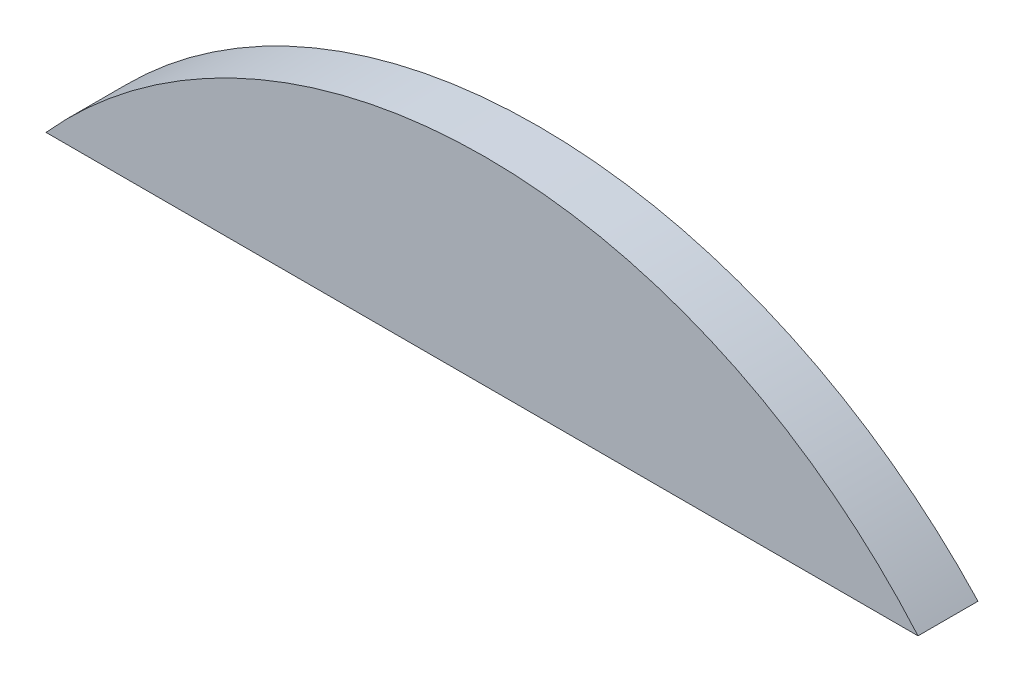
from build123d import *

# Parameters (mm, degrees)
EXTRUDE1_DEPTH = 1.5
DRAFT1_ANGLE   = 1


with BuildPart() as part:
    # Sketch1 → Extrude1 (new, symmetric)
    with BuildSketch(Plane.XY):
        with BuildLine():
            Line((-24.596747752, 22), (24.596747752, 22))
            ThreePointArc((24.596747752, 22), (0, 33), (-24.596747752, 22))
        make_face()
    extrude(amount=EXTRUDE1_DEPTH, both=True)

    # Draft1
    draft1_faces = [part.faces().sort_by_distance(p)[0] for p in [
        (0, 26.469615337, -1.5),
        (0, 26.469615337, 1.5),
    ]]
    draft(draft1_faces, Plane(origin=(0, 33, 0), x_dir=(1, 0, 0), z_dir=(0, 1, 0)), DRAFT1_ANGLE)


solid = part.part
